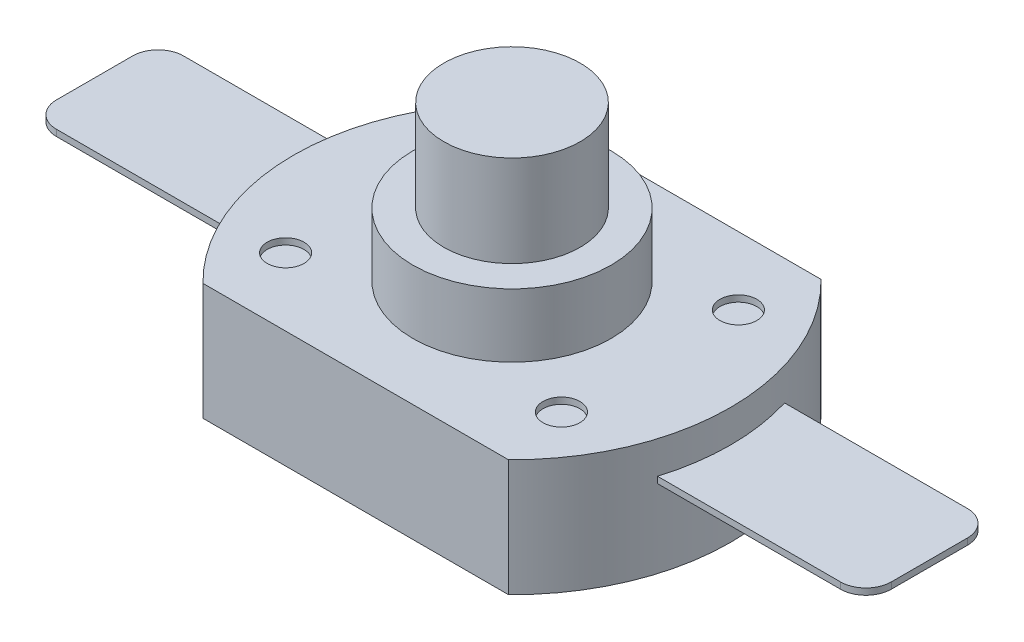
ISO-10303-21;
HEADER;
FILE_DESCRIPTION(('STEP AP214'),'2;1');
FILE_NAME('part.step','',(''),(''),'','','');
FILE_SCHEMA(('AUTOMOTIVE_DESIGN { 1 0 10303 214 1 1 1 1 }'));
ENDSEC;
DATA;
#1=APPLICATION_CONTEXT('core data for automotive mechanical design processes');
#2=APPLICATION_PROTOCOL_DEFINITION('international standard','automotive_design',2000,#1);
#3=PRODUCT_CONTEXT('',#1,'mechanical');
#4=PRODUCT('Part','Part','',(#3));
#5=PRODUCT_RELATED_PRODUCT_CATEGORY('part','',(#4));
#6=PRODUCT_DEFINITION_FORMATION('','',#4);
#7=PRODUCT_DEFINITION_CONTEXT('part definition',#1,'design');
#8=PRODUCT_DEFINITION('design','',#6,#7);
#9=PRODUCT_DEFINITION_SHAPE('','',#8);
#10=(LENGTH_UNIT() NAMED_UNIT(*) SI_UNIT(.MILLI.,.METRE.));
#11=(NAMED_UNIT(*) PLANE_ANGLE_UNIT() SI_UNIT($,.RADIAN.));
#12=(NAMED_UNIT(*) SI_UNIT($,.STERADIAN.) SOLID_ANGLE_UNIT());
#13=UNCERTAINTY_MEASURE_WITH_UNIT(LENGTH_MEASURE(1.E-05),#10,'distance_accuracy_value','');
#14=(GEOMETRIC_REPRESENTATION_CONTEXT(3) GLOBAL_UNCERTAINTY_ASSIGNED_CONTEXT((#13)) GLOBAL_UNIT_ASSIGNED_CONTEXT((#10,
#11,#12)) REPRESENTATION_CONTEXT('',''));
#15=CARTESIAN_POINT('',(0.,0.,0.));
#16=DIRECTION('',(0.,0.,1.));
#17=DIRECTION('',(1.,0.,0.));
#18=AXIS2_PLACEMENT_3D('',#15,#16,#17);
#19=CARTESIAN_POINT('',(0.,4.6,0.));
#20=DIRECTION('',(0.,-1.,0.));
#21=DIRECTION('',(0.,0.,-1.));
#22=AXIS2_PLACEMENT_3D('',#19,#20,#21);
#23=CYLINDRICAL_SURFACE('',#22,8.6);
#24=CARTESIAN_POINT('',(0.,0.,0.));
#25=DIRECTION('',(0.,1.,0.));
#26=DIRECTION('',(0.,0.,1.));
#27=AXIS2_PLACEMENT_3D('',#24,#25,#26);
#28=CIRCLE('',#27,8.6);
#29=CARTESIAN_POINT('',(6.01144741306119,0.,6.15));
#30=VERTEX_POINT('',#29);
#31=CARTESIAN_POINT('',(6.01144741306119,0.,-6.15));
#32=VERTEX_POINT('',#31);
#33=EDGE_CURVE('E243',#30,#32,#28,.T.);
#34=ORIENTED_EDGE('',*,*,#33,.T.);
#35=DIRECTION('',(0.,-1.,0.));
#36=VECTOR('',#35,1.);
#37=CARTESIAN_POINT('',(6.01144741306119,4.6,-6.15));
#38=LINE('',#37,#36);
#39=CARTESIAN_POINT('',(6.01144741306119,4.6,-6.15));
#40=VERTEX_POINT('',#39);
#41=EDGE_CURVE('E259',#40,#32,#38,.T.);
#42=ORIENTED_EDGE('',*,*,#41,.F.);
#43=CARTESIAN_POINT('',(0.,4.6,0.));
#44=DIRECTION('',(0.,1.,0.));
#45=DIRECTION('',(0.,0.,1.));
#46=AXIS2_PLACEMENT_3D('',#43,#44,#45);
#47=CIRCLE('',#46,8.6);
#48=CARTESIAN_POINT('',(6.01144741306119,4.6,6.15));
#49=VERTEX_POINT('',#48);
#50=EDGE_CURVE('E252',#49,#40,#47,.T.);
#51=ORIENTED_EDGE('',*,*,#50,.F.);
#52=DIRECTION('',(0.,-1.,0.));
#53=VECTOR('',#52,1.);
#54=CARTESIAN_POINT('',(6.01144741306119,4.6,6.15));
#55=LINE('',#54,#53);
#56=EDGE_CURVE('E262',#49,#30,#55,.T.);
#57=ORIENTED_EDGE('',*,*,#56,.T.);
#58=EDGE_LOOP('',(#34,#42,#51,#57));
#59=FACE_BOUND('',#58,.T.);
#60=CARTESIAN_POINT('',(0.,3.32,0.));
#61=DIRECTION('',(0.,-1.,0.));
#62=DIRECTION('',(0.,0.,-1.));
#63=AXIS2_PLACEMENT_3D('',#60,#61,#62);
#64=CIRCLE('',#63,8.6);
#65=CARTESIAN_POINT('',(8.22860863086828,3.32,-2.5));
#66=VERTEX_POINT('',#65);
#67=CARTESIAN_POINT('',(8.22860863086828,3.32,2.5));
#68=VERTEX_POINT('',#67);
#69=EDGE_CURVE('E11',#66,#68,#64,.T.);
#70=ORIENTED_EDGE('',*,*,#69,.F.);
#71=DIRECTION('',(0.,-1.,0.));
#72=VECTOR('',#71,1.);
#73=CARTESIAN_POINT('',(8.22860863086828,3.32,-2.5));
#74=LINE('',#73,#72);
#75=CARTESIAN_POINT('',(8.22860863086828,3.07,-2.5));
#76=VERTEX_POINT('',#75);
#77=EDGE_CURVE('E156',#66,#76,#74,.T.);
#78=ORIENTED_EDGE('',*,*,#77,.T.);
#79=CARTESIAN_POINT('',(0.,3.07,0.));
#80=DIRECTION('',(0.,-1.,0.));
#81=DIRECTION('',(0.,0.,-1.));
#82=AXIS2_PLACEMENT_3D('',#79,#80,#81);
#83=CIRCLE('',#82,8.6);
#84=CARTESIAN_POINT('',(8.22860863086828,3.07,2.5));
#85=VERTEX_POINT('',#84);
#86=EDGE_CURVE('E34',#76,#85,#83,.T.);
#87=ORIENTED_EDGE('',*,*,#86,.T.);
#88=DIRECTION('',(0.,-1.,0.));
#89=VECTOR('',#88,1.);
#90=CARTESIAN_POINT('',(8.22860863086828,3.32,2.5));
#91=LINE('',#90,#89);
#92=EDGE_CURVE('E190',#68,#85,#91,.T.);
#93=ORIENTED_EDGE('',*,*,#92,.F.);
#94=EDGE_LOOP('',(#70,#78,#87,#93));
#95=FACE_BOUND('',#94,.T.);
#96=ADVANCED_FACE('F26',(#59,#95),#23,.T.);
#97=CARTESIAN_POINT('',(0.,7.1,0.));
#98=DIRECTION('',(0.,1.,0.));
#99=DIRECTION('',(0.,0.,1.));
#100=AXIS2_PLACEMENT_3D('',#97,#98,#99);
#101=PLANE('',#100);
#102=CARTESIAN_POINT('',(0.,7.1,0.));
#103=DIRECTION('',(0.,1.,0.));
#104=DIRECTION('',(0.,0.,1.));
#105=AXIS2_PLACEMENT_3D('',#102,#103,#104);
#106=CIRCLE('',#105,3.9);
#107=CARTESIAN_POINT('',(0.,7.1,3.9));
#108=VERTEX_POINT('',#107);
#109=EDGE_CURVE('E235',#108,#108,#106,.T.);
#110=ORIENTED_EDGE('',*,*,#109,.T.);
#111=EDGE_LOOP('',(#110));
#112=FACE_BOUND('',#111,.T.);
#113=CARTESIAN_POINT('',(0.,7.1,0.));
#114=DIRECTION('',(0.,1.,0.));
#115=DIRECTION('',(0.,0.,1.));
#116=AXIS2_PLACEMENT_3D('',#113,#114,#115);
#117=CIRCLE('',#116,2.683);
#118=CARTESIAN_POINT('',(0.,7.1,2.683));
#119=VERTEX_POINT('',#118);
#120=EDGE_CURVE('E229',#119,#119,#117,.T.);
#121=ORIENTED_EDGE('',*,*,#120,.F.);
#122=EDGE_LOOP('',(#121));
#123=FACE_BOUND('',#122,.T.);
#124=ADVANCED_FACE('F305',(#112,#123),#101,.T.);
#125=CARTESIAN_POINT('',(0.,4.6,0.));
#126=DIRECTION('',(0.,-1.,0.));
#127=DIRECTION('',(0.,0.,-1.));
#128=AXIS2_PLACEMENT_3D('',#125,#126,#127);
#129=PLANE('',#128);
#130=CARTESIAN_POINT('',(-5.42779033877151,4.6,3.48197870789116));
#131=DIRECTION('',(0.,1.,0.));
#132=DIRECTION('',(0.,0.,-1.));
#133=AXIS2_PLACEMENT_3D('',#130,#131,#132);
#134=CIRCLE('',#133,0.725763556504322);
#135=CARTESIAN_POINT('',(-5.42779033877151,4.6,2.75621515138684));
#136=VERTEX_POINT('',#135);
#137=EDGE_CURVE('E548',#136,#136,#134,.T.);
#138=ORIENTED_EDGE('',*,*,#137,.F.);
#139=EDGE_LOOP('',(#138));
#140=FACE_BOUND('',#139,.T.);
#141=CARTESIAN_POINT('',(-5.42779033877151,4.6,-3.48197870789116));
#142=DIRECTION('',(0.,1.,0.));
#143=DIRECTION('',(0.,0.,1.));
#144=AXIS2_PLACEMENT_3D('',#141,#142,#143);
#145=CIRCLE('',#144,0.725763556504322);
#146=CARTESIAN_POINT('',(-5.42779033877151,4.6,-2.75621515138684));
#147=VERTEX_POINT('',#146);
#148=EDGE_CURVE('E547',#147,#147,#145,.T.);
#149=ORIENTED_EDGE('',*,*,#148,.F.);
#150=EDGE_LOOP('',(#149));
#151=FACE_BOUND('',#150,.T.);
#152=CARTESIAN_POINT('',(5.42779033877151,4.6,-3.48197870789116));
#153=DIRECTION('',(0.,1.,0.));
#154=DIRECTION('',(0.,0.,-1.));
#155=AXIS2_PLACEMENT_3D('',#152,#153,#154);
#156=CIRCLE('',#155,0.725763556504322);
#157=CARTESIAN_POINT('',(5.42779033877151,4.6,-4.20774226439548));
#158=VERTEX_POINT('',#157);
#159=EDGE_CURVE('E558',#158,#158,#156,.T.);
#160=ORIENTED_EDGE('',*,*,#159,.F.);
#161=EDGE_LOOP('',(#160));
#162=FACE_BOUND('',#161,.T.);
#163=CARTESIAN_POINT('',(5.42779033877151,4.6,3.48197870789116));
#164=DIRECTION('',(0.,1.,0.));
#165=DIRECTION('',(0.,0.,1.));
#166=AXIS2_PLACEMENT_3D('',#163,#164,#165);
#167=CIRCLE('',#166,0.725763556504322);
#168=CARTESIAN_POINT('',(5.42779033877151,4.6,4.20774226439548));
#169=VERTEX_POINT('',#168);
#170=EDGE_CURVE('E165',#169,#169,#167,.T.);
#171=ORIENTED_EDGE('',*,*,#170,.F.);
#172=EDGE_LOOP('',(#171));
#173=FACE_BOUND('',#172,.T.);
#174=CARTESIAN_POINT('',(0.,4.6,0.));
#175=DIRECTION('',(0.,1.,0.));
#176=DIRECTION('',(0.,0.,-1.));
#177=AXIS2_PLACEMENT_3D('',#174,#175,#176);
#178=CIRCLE('',#177,8.6);
#179=CARTESIAN_POINT('',(-6.01144741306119,4.6,-6.15));
#180=VERTEX_POINT('',#179);
#181=CARTESIAN_POINT('',(-6.01144741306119,4.6,6.15));
#182=VERTEX_POINT('',#181);
#183=EDGE_CURVE('E247',#180,#182,#178,.T.);
#184=ORIENTED_EDGE('',*,*,#183,.T.);
#185=DIRECTION('',(1.,0.,0.));
#186=VECTOR('',#185,1.);
#187=CARTESIAN_POINT('',(-6.01144741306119,4.6,6.15));
#188=LINE('',#187,#186);
#189=EDGE_CURVE('E250',#182,#49,#188,.T.);
#190=ORIENTED_EDGE('',*,*,#189,.T.);
#191=ORIENTED_EDGE('',*,*,#50,.T.);
#192=DIRECTION('',(-1.,0.,0.));
#193=VECTOR('',#192,1.);
#194=CARTESIAN_POINT('',(6.01144741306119,4.6,-6.15));
#195=LINE('',#194,#193);
#196=EDGE_CURVE('E254',#40,#180,#195,.T.);
#197=ORIENTED_EDGE('',*,*,#196,.T.);
#198=EDGE_LOOP('',(#184,#190,#191,#197));
#199=FACE_BOUND('',#198,.T.);
#200=CARTESIAN_POINT('',(0.,4.6,0.));
#201=DIRECTION('',(0.,-1.,0.));
#202=DIRECTION('',(0.,0.,-1.));
#203=AXIS2_PLACEMENT_3D('',#200,#201,#202);
#204=CIRCLE('',#203,3.9);
#205=CARTESIAN_POINT('',(0.,4.6,-3.9));
#206=VERTEX_POINT('',#205);
#207=EDGE_CURVE('E268',#206,#206,#204,.F.);
#208=ORIENTED_EDGE('',*,*,#207,.F.);
#209=EDGE_LOOP('',(#208));
#210=FACE_BOUND('',#209,.T.);
#211=ADVANCED_FACE('F313',(#140,#151,#162,#173,#199,#210),#129,.F.);
#212=CARTESIAN_POINT('',(0.,4.6,0.));
#213=DIRECTION('',(0.,-1.,0.));
#214=DIRECTION('',(0.,0.,-1.));
#215=AXIS2_PLACEMENT_3D('',#212,#213,#214);
#216=CYLINDRICAL_SURFACE('',#215,8.6);
#217=DIRECTION('',(0.,-1.,0.));
#218=VECTOR('',#217,1.);
#219=CARTESIAN_POINT('',(-8.22860863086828,3.32,-2.5));
#220=LINE('',#219,#218);
#221=CARTESIAN_POINT('',(-8.22860863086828,3.32,-2.5));
#222=VERTEX_POINT('',#221);
#223=CARTESIAN_POINT('',(-8.22860863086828,3.07,-2.5));
#224=VERTEX_POINT('',#223);
#225=EDGE_CURVE('E49',#222,#224,#220,.T.);
#226=ORIENTED_EDGE('',*,*,#225,.F.);
#227=CARTESIAN_POINT('',(0.,3.32,0.));
#228=DIRECTION('',(0.,1.,0.));
#229=DIRECTION('',(0.,0.,1.));
#230=AXIS2_PLACEMENT_3D('',#227,#228,#229);
#231=CIRCLE('',#230,8.6);
#232=CARTESIAN_POINT('',(-8.22860863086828,3.32,2.5));
#233=VERTEX_POINT('',#232);
#234=EDGE_CURVE('E274',#222,#233,#231,.T.);
#235=ORIENTED_EDGE('',*,*,#234,.T.);
#236=DIRECTION('',(0.,-1.,0.));
#237=VECTOR('',#236,1.);
#238=CARTESIAN_POINT('',(-8.22860863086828,3.32,2.5));
#239=LINE('',#238,#237);
#240=CARTESIAN_POINT('',(-8.22860863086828,3.07,2.5));
#241=VERTEX_POINT('',#240);
#242=EDGE_CURVE('E214',#233,#241,#239,.T.);
#243=ORIENTED_EDGE('',*,*,#242,.T.);
#244=CARTESIAN_POINT('',(0.,3.07,0.));
#245=DIRECTION('',(0.,1.,0.));
#246=DIRECTION('',(0.,0.,1.));
#247=AXIS2_PLACEMENT_3D('',#244,#245,#246);
#248=CIRCLE('',#247,8.6);
#249=EDGE_CURVE('E271',#224,#241,#248,.T.);
#250=ORIENTED_EDGE('',*,*,#249,.F.);
#251=EDGE_LOOP('',(#226,#235,#243,#250));
#252=FACE_BOUND('',#251,.T.);
#253=CARTESIAN_POINT('',(0.,0.,0.));
#254=DIRECTION('',(0.,1.,0.));
#255=DIRECTION('',(0.,0.,-1.));
#256=AXIS2_PLACEMENT_3D('',#253,#254,#255);
#257=CIRCLE('',#256,8.6);
#258=CARTESIAN_POINT('',(-6.01144741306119,0.,-6.15));
#259=VERTEX_POINT('',#258);
#260=CARTESIAN_POINT('',(-6.01144741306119,0.,6.15));
#261=VERTEX_POINT('',#260);
#262=EDGE_CURVE('E238',#259,#261,#257,.T.);
#263=ORIENTED_EDGE('',*,*,#262,.T.);
#264=DIRECTION('',(0.,-1.,0.));
#265=VECTOR('',#264,1.);
#266=CARTESIAN_POINT('',(-6.01144741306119,4.6,6.15));
#267=LINE('',#266,#265);
#268=EDGE_CURVE('E265',#182,#261,#267,.T.);
#269=ORIENTED_EDGE('',*,*,#268,.F.);
#270=ORIENTED_EDGE('',*,*,#183,.F.);
#271=DIRECTION('',(0.,-1.,0.));
#272=VECTOR('',#271,1.);
#273=CARTESIAN_POINT('',(-6.01144741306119,4.6,-6.15));
#274=LINE('',#273,#272);
#275=EDGE_CURVE('E256',#180,#259,#274,.T.);
#276=ORIENTED_EDGE('',*,*,#275,.T.);
#277=EDGE_LOOP('',(#263,#269,#270,#276));
#278=FACE_BOUND('',#277,.T.);
#279=ADVANCED_FACE('F28',(#252,#278),#216,.T.);
#280=CARTESIAN_POINT('',(-6.01144741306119,4.6,6.15));
#281=DIRECTION('',(0.,0.,-1.));
#282=DIRECTION('',(-1.,0.,0.));
#283=AXIS2_PLACEMENT_3D('',#280,#281,#282);
#284=PLANE('',#283);
#285=DIRECTION('',(1.,0.,0.));
#286=VECTOR('',#285,1.);
#287=CARTESIAN_POINT('',(-6.01144741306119,0.,6.15));
#288=LINE('',#287,#286);
#289=EDGE_CURVE('E241',#261,#30,#288,.T.);
#290=ORIENTED_EDGE('',*,*,#289,.T.);
#291=ORIENTED_EDGE('',*,*,#56,.F.);
#292=ORIENTED_EDGE('',*,*,#189,.F.);
#293=ORIENTED_EDGE('',*,*,#268,.T.);
#294=EDGE_LOOP('',(#290,#291,#292,#293));
#295=FACE_BOUND('',#294,.T.);
#296=ADVANCED_FACE('F319',(#295),#284,.F.);
#297=CARTESIAN_POINT('',(6.01144741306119,4.6,-6.15));
#298=DIRECTION('',(0.,0.,1.));
#299=DIRECTION('',(1.,0.,0.));
#300=AXIS2_PLACEMENT_3D('',#297,#298,#299);
#301=PLANE('',#300);
#302=DIRECTION('',(-1.,0.,0.));
#303=VECTOR('',#302,1.);
#304=CARTESIAN_POINT('',(6.01144741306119,0.,-6.15));
#305=LINE('',#304,#303);
#306=EDGE_CURVE('E245',#32,#259,#305,.T.);
#307=ORIENTED_EDGE('',*,*,#306,.T.);
#308=ORIENTED_EDGE('',*,*,#275,.F.);
#309=ORIENTED_EDGE('',*,*,#196,.F.);
#310=ORIENTED_EDGE('',*,*,#41,.T.);
#311=EDGE_LOOP('',(#307,#308,#309,#310));
#312=FACE_BOUND('',#311,.T.);
#313=ADVANCED_FACE('F317',(#312),#301,.F.);
#314=CARTESIAN_POINT('',(0.,0.,0.));
#315=DIRECTION('',(0.,-1.,0.));
#316=DIRECTION('',(0.,0.,-1.));
#317=AXIS2_PLACEMENT_3D('',#314,#315,#316);
#318=PLANE('',#317);
#319=ORIENTED_EDGE('',*,*,#262,.F.);
#320=ORIENTED_EDGE('',*,*,#306,.F.);
#321=ORIENTED_EDGE('',*,*,#33,.F.);
#322=ORIENTED_EDGE('',*,*,#289,.F.);
#323=EDGE_LOOP('',(#319,#320,#321,#322));
#324=FACE_BOUND('',#323,.T.);
#325=ADVANCED_FACE('F325',(#324),#318,.T.);
#326=CARTESIAN_POINT('',(0.,7.1,0.));
#327=DIRECTION('',(0.,-1.,0.));
#328=DIRECTION('',(0.,0.,-1.));
#329=AXIS2_PLACEMENT_3D('',#326,#327,#328);
#330=CYLINDRICAL_SURFACE('',#329,3.9);
#331=ORIENTED_EDGE('',*,*,#109,.F.);
#332=EDGE_LOOP('',(#331));
#333=FACE_BOUND('',#332,.T.);
#334=ORIENTED_EDGE('',*,*,#207,.T.);
#335=EDGE_LOOP('',(#334));
#336=FACE_BOUND('',#335,.T.);
#337=ADVANCED_FACE('F344',(#333,#336),#330,.T.);
#338=CARTESIAN_POINT('',(0.,10.7,0.));
#339=DIRECTION('',(0.,-1.,0.));
#340=DIRECTION('',(0.,0.,-1.));
#341=AXIS2_PLACEMENT_3D('',#338,#339,#340);
#342=CYLINDRICAL_SURFACE('',#341,2.683);
#343=CARTESIAN_POINT('',(0.,10.7,0.));
#344=DIRECTION('',(0.,1.,0.));
#345=DIRECTION('',(0.,0.,1.));
#346=AXIS2_PLACEMENT_3D('',#343,#344,#345);
#347=CIRCLE('',#346,2.683);
#348=CARTESIAN_POINT('',(0.,10.7,2.683));
#349=VERTEX_POINT('',#348);
#350=EDGE_CURVE('E232',#349,#349,#347,.T.);
#351=ORIENTED_EDGE('',*,*,#350,.F.);
#352=EDGE_LOOP('',(#351));
#353=FACE_BOUND('',#352,.T.);
#354=ORIENTED_EDGE('',*,*,#120,.T.);
#355=EDGE_LOOP('',(#354));
#356=FACE_BOUND('',#355,.T.);
#357=ADVANCED_FACE('F346',(#353,#356),#342,.T.);
#358=CARTESIAN_POINT('',(0.,10.7,0.));
#359=DIRECTION('',(0.,1.,0.));
#360=DIRECTION('',(0.,0.,1.));
#361=AXIS2_PLACEMENT_3D('',#358,#359,#360);
#362=PLANE('',#361);
#363=ORIENTED_EDGE('',*,*,#350,.T.);
#364=EDGE_LOOP('',(#363));
#365=FACE_BOUND('',#364,.T.);
#366=ADVANCED_FACE('F353',(#365),#362,.T.);
#367=CARTESIAN_POINT('',(-15.4286086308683,3.32,-1.5));
#368=DIRECTION('',(0.,1.,0.));
#369=DIRECTION('',(0.,0.,1.));
#370=AXIS2_PLACEMENT_3D('',#367,#368,#369);
#371=PLANE('',#370);
#372=ORIENTED_EDGE('',*,*,#234,.F.);
#373=DIRECTION('',(-1.,0.,0.));
#374=VECTOR('',#373,1.);
#375=CARTESIAN_POINT('',(-8.22860863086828,3.32,-2.5));
#376=LINE('',#375,#374);
#377=CARTESIAN_POINT('',(-15.4286086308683,3.32,-2.5));
#378=VERTEX_POINT('',#377);
#379=EDGE_CURVE('E203',#222,#378,#376,.T.);
#380=ORIENTED_EDGE('',*,*,#379,.T.);
#381=CARTESIAN_POINT('',(-15.4286086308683,3.32,-1.5));
#382=DIRECTION('',(0.,1.,0.));
#383=DIRECTION('',(0.,0.,1.));
#384=AXIS2_PLACEMENT_3D('',#381,#382,#383);
#385=CIRCLE('',#384,1.);
#386=CARTESIAN_POINT('',(-16.4286086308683,3.32,-1.5));
#387=VERTEX_POINT('',#386);
#388=EDGE_CURVE('E205',#378,#387,#385,.T.);
#389=ORIENTED_EDGE('',*,*,#388,.T.);
#390=DIRECTION('',(0.,0.,1.));
#391=VECTOR('',#390,1.);
#392=CARTESIAN_POINT('',(-16.4286086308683,3.32,1.5));
#393=LINE('',#392,#391);
#394=CARTESIAN_POINT('',(-16.4286086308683,3.32,1.5));
#395=VERTEX_POINT('',#394);
#396=EDGE_CURVE('E207',#387,#395,#393,.T.);
#397=ORIENTED_EDGE('',*,*,#396,.T.);
#398=CARTESIAN_POINT('',(-15.4286086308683,3.32,1.5));
#399=DIRECTION('',(0.,1.,0.));
#400=DIRECTION('',(0.,0.,-1.));
#401=AXIS2_PLACEMENT_3D('',#398,#399,#400);
#402=CIRCLE('',#401,1.);
#403=CARTESIAN_POINT('',(-15.4286086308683,3.32,2.5));
#404=VERTEX_POINT('',#403);
#405=EDGE_CURVE('E209',#395,#404,#402,.T.);
#406=ORIENTED_EDGE('',*,*,#405,.T.);
#407=DIRECTION('',(1.,0.,0.));
#408=VECTOR('',#407,1.);
#409=CARTESIAN_POINT('',(-8.22860863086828,3.32,2.5));
#410=LINE('',#409,#408);
#411=EDGE_CURVE('E211',#404,#233,#410,.T.);
#412=ORIENTED_EDGE('',*,*,#411,.T.);
#413=EDGE_LOOP('',(#372,#380,#389,#397,#406,#412));
#414=FACE_BOUND('',#413,.T.);
#415=ADVANCED_FACE('F360',(#414),#371,.T.);
#416=CARTESIAN_POINT('',(-15.4286086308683,3.07,-1.5));
#417=DIRECTION('',(0.,1.,0.));
#418=DIRECTION('',(0.,0.,1.));
#419=AXIS2_PLACEMENT_3D('',#416,#417,#418);
#420=PLANE('',#419);
#421=DIRECTION('',(-1.,0.,0.));
#422=VECTOR('',#421,1.);
#423=CARTESIAN_POINT('',(-8.22860863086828,3.07,-2.5));
#424=LINE('',#423,#422);
#425=CARTESIAN_POINT('',(-15.4286086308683,3.07,-2.5));
#426=VERTEX_POINT('',#425);
#427=EDGE_CURVE('E155',#224,#426,#424,.T.);
#428=ORIENTED_EDGE('',*,*,#427,.F.);
#429=ORIENTED_EDGE('',*,*,#249,.T.);
#430=DIRECTION('',(1.,0.,0.));
#431=VECTOR('',#430,1.);
#432=CARTESIAN_POINT('',(-8.22860863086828,3.07,2.5));
#433=LINE('',#432,#431);
#434=CARTESIAN_POINT('',(-15.4286086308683,3.07,2.5));
#435=VERTEX_POINT('',#434);
#436=EDGE_CURVE('E200',#435,#241,#433,.T.);
#437=ORIENTED_EDGE('',*,*,#436,.F.);
#438=CARTESIAN_POINT('',(-15.4286086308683,3.07,1.5));
#439=DIRECTION('',(0.,1.,0.));
#440=DIRECTION('',(0.,0.,-1.));
#441=AXIS2_PLACEMENT_3D('',#438,#439,#440);
#442=CIRCLE('',#441,1.);
#443=CARTESIAN_POINT('',(-16.4286086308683,3.07,1.5));
#444=VERTEX_POINT('',#443);
#445=EDGE_CURVE('E198',#444,#435,#442,.T.);
#446=ORIENTED_EDGE('',*,*,#445,.F.);
#447=DIRECTION('',(0.,0.,1.));
#448=VECTOR('',#447,1.);
#449=CARTESIAN_POINT('',(-16.4286086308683,3.07,1.5));
#450=LINE('',#449,#448);
#451=CARTESIAN_POINT('',(-16.4286086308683,3.07,-1.5));
#452=VERTEX_POINT('',#451);
#453=EDGE_CURVE('E196',#452,#444,#450,.T.);
#454=ORIENTED_EDGE('',*,*,#453,.F.);
#455=CARTESIAN_POINT('',(-15.4286086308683,3.07,-1.5));
#456=DIRECTION('',(0.,1.,0.));
#457=DIRECTION('',(0.,0.,1.));
#458=AXIS2_PLACEMENT_3D('',#455,#456,#457);
#459=CIRCLE('',#458,1.);
#460=EDGE_CURVE('E194',#426,#452,#459,.T.);
#461=ORIENTED_EDGE('',*,*,#460,.F.);
#462=EDGE_LOOP('',(#428,#429,#437,#446,#454,#461));
#463=FACE_BOUND('',#462,.T.);
#464=ADVANCED_FACE('F366',(#463),#420,.F.);
#465=CARTESIAN_POINT('',(-8.22860863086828,3.32,-2.5));
#466=DIRECTION('',(0.,0.,1.));
#467=DIRECTION('',(1.,0.,0.));
#468=AXIS2_PLACEMENT_3D('',#465,#466,#467);
#469=PLANE('',#468);
#470=ORIENTED_EDGE('',*,*,#427,.T.);
#471=DIRECTION('',(0.,-1.,0.));
#472=VECTOR('',#471,1.);
#473=CARTESIAN_POINT('',(-15.4286086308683,3.32,-2.5));
#474=LINE('',#473,#472);
#475=EDGE_CURVE('E225',#378,#426,#474,.T.);
#476=ORIENTED_EDGE('',*,*,#475,.F.);
#477=ORIENTED_EDGE('',*,*,#379,.F.);
#478=ORIENTED_EDGE('',*,*,#225,.T.);
#479=EDGE_LOOP('',(#470,#476,#477,#478));
#480=FACE_BOUND('',#479,.T.);
#481=ADVANCED_FACE('F362',(#480),#469,.F.);
#482=CARTESIAN_POINT('',(-15.4286086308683,3.32,-1.5));
#483=DIRECTION('',(0.,-1.,0.));
#484=DIRECTION('',(0.,0.,-1.));
#485=AXIS2_PLACEMENT_3D('',#482,#483,#484);
#486=CYLINDRICAL_SURFACE('',#485,1.);
#487=ORIENTED_EDGE('',*,*,#460,.T.);
#488=DIRECTION('',(0.,-1.,0.));
#489=VECTOR('',#488,1.);
#490=CARTESIAN_POINT('',(-16.4286086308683,3.32,-1.5));
#491=LINE('',#490,#489);
#492=EDGE_CURVE('E222',#387,#452,#491,.T.);
#493=ORIENTED_EDGE('',*,*,#492,.F.);
#494=ORIENTED_EDGE('',*,*,#388,.F.);
#495=ORIENTED_EDGE('',*,*,#475,.T.);
#496=EDGE_LOOP('',(#487,#493,#494,#495));
#497=FACE_BOUND('',#496,.T.);
#498=ADVANCED_FACE('F365',(#497),#486,.T.);
#499=CARTESIAN_POINT('',(-16.4286086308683,3.32,1.5));
#500=DIRECTION('',(1.,0.,0.));
#501=DIRECTION('',(0.,0.,-1.));
#502=AXIS2_PLACEMENT_3D('',#499,#500,#501);
#503=PLANE('',#502);
#504=ORIENTED_EDGE('',*,*,#453,.T.);
#505=DIRECTION('',(0.,-1.,0.));
#506=VECTOR('',#505,1.);
#507=CARTESIAN_POINT('',(-16.4286086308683,3.32,1.5));
#508=LINE('',#507,#506);
#509=EDGE_CURVE('E219',#395,#444,#508,.T.);
#510=ORIENTED_EDGE('',*,*,#509,.F.);
#511=ORIENTED_EDGE('',*,*,#396,.F.);
#512=ORIENTED_EDGE('',*,*,#492,.T.);
#513=EDGE_LOOP('',(#504,#510,#511,#512));
#514=FACE_BOUND('',#513,.T.);
#515=ADVANCED_FACE('F370',(#514),#503,.F.);
#516=CARTESIAN_POINT('',(-15.4286086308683,3.32,1.5));
#517=DIRECTION('',(0.,-1.,0.));
#518=DIRECTION('',(0.,0.,-1.));
#519=AXIS2_PLACEMENT_3D('',#516,#517,#518);
#520=CYLINDRICAL_SURFACE('',#519,1.);
#521=ORIENTED_EDGE('',*,*,#445,.T.);
#522=DIRECTION('',(0.,-1.,0.));
#523=VECTOR('',#522,1.);
#524=CARTESIAN_POINT('',(-15.4286086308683,3.32,2.5));
#525=LINE('',#524,#523);
#526=EDGE_CURVE('E216',#404,#435,#525,.T.);
#527=ORIENTED_EDGE('',*,*,#526,.F.);
#528=ORIENTED_EDGE('',*,*,#405,.F.);
#529=ORIENTED_EDGE('',*,*,#509,.T.);
#530=EDGE_LOOP('',(#521,#527,#528,#529));
#531=FACE_BOUND('',#530,.T.);
#532=ADVANCED_FACE('F374',(#531),#520,.T.);
#533=CARTESIAN_POINT('',(-8.22860863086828,3.32,2.5));
#534=DIRECTION('',(0.,0.,-1.));
#535=DIRECTION('',(-1.,0.,0.));
#536=AXIS2_PLACEMENT_3D('',#533,#534,#535);
#537=PLANE('',#536);
#538=ORIENTED_EDGE('',*,*,#436,.T.);
#539=ORIENTED_EDGE('',*,*,#242,.F.);
#540=ORIENTED_EDGE('',*,*,#411,.F.);
#541=ORIENTED_EDGE('',*,*,#526,.T.);
#542=EDGE_LOOP('',(#538,#539,#540,#541));
#543=FACE_BOUND('',#542,.T.);
#544=ADVANCED_FACE('F378',(#543),#537,.F.);
#545=CARTESIAN_POINT('',(15.4286086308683,3.32,-1.5));
#546=DIRECTION('',(0.,-1.,0.));
#547=DIRECTION('',(0.,0.,-1.));
#548=AXIS2_PLACEMENT_3D('',#545,#546,#547);
#549=PLANE('',#548);
#550=DIRECTION('',(-1.,0.,0.));
#551=VECTOR('',#550,1.);
#552=CARTESIAN_POINT('',(8.22860863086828,3.32,-2.5));
#553=LINE('',#552,#551);
#554=CARTESIAN_POINT('',(15.4286086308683,3.32,-2.5));
#555=VERTEX_POINT('',#554);
#556=EDGE_CURVE('E151',#555,#66,#553,.T.);
#557=ORIENTED_EDGE('',*,*,#556,.T.);
#558=ORIENTED_EDGE('',*,*,#69,.T.);
#559=DIRECTION('',(1.,0.,0.));
#560=VECTOR('',#559,1.);
#561=CARTESIAN_POINT('',(8.22860863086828,3.32,2.5));
#562=LINE('',#561,#560);
#563=CARTESIAN_POINT('',(15.4286086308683,3.32,2.5));
#564=VERTEX_POINT('',#563);
#565=EDGE_CURVE('E177',#68,#564,#562,.T.);
#566=ORIENTED_EDGE('',*,*,#565,.T.);
#567=CARTESIAN_POINT('',(15.4286086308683,3.32,1.5));
#568=DIRECTION('',(0.,1.,0.));
#569=DIRECTION('',(0.,0.,1.));
#570=AXIS2_PLACEMENT_3D('',#567,#568,#569);
#571=CIRCLE('',#570,1.);
#572=CARTESIAN_POINT('',(16.4286086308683,3.32,1.5));
#573=VERTEX_POINT('',#572);
#574=EDGE_CURVE('E179',#564,#573,#571,.T.);
#575=ORIENTED_EDGE('',*,*,#574,.T.);
#576=DIRECTION('',(0.,0.,-1.));
#577=VECTOR('',#576,1.);
#578=CARTESIAN_POINT('',(16.4286086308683,3.32,1.5));
#579=LINE('',#578,#577);
#580=CARTESIAN_POINT('',(16.4286086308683,3.32,-1.5));
#581=VERTEX_POINT('',#580);
#582=EDGE_CURVE('E181',#573,#581,#579,.T.);
#583=ORIENTED_EDGE('',*,*,#582,.T.);
#584=CARTESIAN_POINT('',(15.4286086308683,3.32,-1.5));
#585=DIRECTION('',(0.,1.,0.));
#586=DIRECTION('',(0.,0.,-1.));
#587=AXIS2_PLACEMENT_3D('',#584,#585,#586);
#588=CIRCLE('',#587,1.);
#589=EDGE_CURVE('E174',#581,#555,#588,.T.);
#590=ORIENTED_EDGE('',*,*,#589,.T.);
#591=EDGE_LOOP('',(#557,#558,#566,#575,#583,#590));
#592=FACE_BOUND('',#591,.T.);
#593=ADVANCED_FACE('F280',(#592),#549,.F.);
#594=CARTESIAN_POINT('',(15.4286086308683,3.07,-1.5));
#595=DIRECTION('',(0.,-1.,0.));
#596=DIRECTION('',(0.,0.,-1.));
#597=AXIS2_PLACEMENT_3D('',#594,#595,#596);
#598=PLANE('',#597);
#599=ORIENTED_EDGE('',*,*,#86,.F.);
#600=DIRECTION('',(-1.,0.,0.));
#601=VECTOR('',#600,1.);
#602=CARTESIAN_POINT('',(8.22860863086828,3.07,-2.5));
#603=LINE('',#602,#601);
#604=CARTESIAN_POINT('',(15.4286086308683,3.07,-2.5));
#605=VERTEX_POINT('',#604);
#606=EDGE_CURVE('E137',#605,#76,#603,.T.);
#607=ORIENTED_EDGE('',*,*,#606,.F.);
#608=CARTESIAN_POINT('',(15.4286086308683,3.07,-1.5));
#609=DIRECTION('',(0.,1.,0.));
#610=DIRECTION('',(0.,0.,-1.));
#611=AXIS2_PLACEMENT_3D('',#608,#609,#610);
#612=CIRCLE('',#611,1.);
#613=CARTESIAN_POINT('',(16.4286086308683,3.07,-1.5));
#614=VERTEX_POINT('',#613);
#615=EDGE_CURVE('E142',#614,#605,#612,.T.);
#616=ORIENTED_EDGE('',*,*,#615,.F.);
#617=DIRECTION('',(0.,0.,-1.));
#618=VECTOR('',#617,1.);
#619=CARTESIAN_POINT('',(16.4286086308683,3.07,1.5));
#620=LINE('',#619,#618);
#621=CARTESIAN_POINT('',(16.4286086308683,3.07,1.5));
#622=VERTEX_POINT('',#621);
#623=EDGE_CURVE('E172',#622,#614,#620,.T.);
#624=ORIENTED_EDGE('',*,*,#623,.F.);
#625=CARTESIAN_POINT('',(15.4286086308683,3.07,1.5));
#626=DIRECTION('',(0.,1.,0.));
#627=DIRECTION('',(0.,0.,1.));
#628=AXIS2_PLACEMENT_3D('',#625,#626,#627);
#629=CIRCLE('',#628,1.);
#630=CARTESIAN_POINT('',(15.4286086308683,3.07,2.5));
#631=VERTEX_POINT('',#630);
#632=EDGE_CURVE('E170',#631,#622,#629,.T.);
#633=ORIENTED_EDGE('',*,*,#632,.F.);
#634=DIRECTION('',(1.,0.,0.));
#635=VECTOR('',#634,1.);
#636=CARTESIAN_POINT('',(8.22860863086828,3.07,2.5));
#637=LINE('',#636,#635);
#638=EDGE_CURVE('E41',#85,#631,#637,.T.);
#639=ORIENTED_EDGE('',*,*,#638,.F.);
#640=EDGE_LOOP('',(#599,#607,#616,#624,#633,#639));
#641=FACE_BOUND('',#640,.T.);
#642=ADVANCED_FACE('F139',(#641),#598,.T.);
#643=CARTESIAN_POINT('',(15.4286086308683,3.32,-1.5));
#644=DIRECTION('',(0.,-1.,0.));
#645=DIRECTION('',(0.,0.,-1.));
#646=AXIS2_PLACEMENT_3D('',#643,#644,#645);
#647=CYLINDRICAL_SURFACE('',#646,1.);
#648=ORIENTED_EDGE('',*,*,#615,.T.);
#649=DIRECTION('',(0.,-1.,0.));
#650=VECTOR('',#649,1.);
#651=CARTESIAN_POINT('',(15.4286086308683,3.32,-2.5));
#652=LINE('',#651,#650);
#653=EDGE_CURVE('E149',#555,#605,#652,.T.);
#654=ORIENTED_EDGE('',*,*,#653,.F.);
#655=ORIENTED_EDGE('',*,*,#589,.F.);
#656=DIRECTION('',(0.,-1.,0.));
#657=VECTOR('',#656,1.);
#658=CARTESIAN_POINT('',(16.4286086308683,3.32,-1.5));
#659=LINE('',#658,#657);
#660=EDGE_CURVE('E161',#581,#614,#659,.T.);
#661=ORIENTED_EDGE('',*,*,#660,.T.);
#662=EDGE_LOOP('',(#648,#654,#655,#661));
#663=FACE_BOUND('',#662,.T.);
#664=ADVANCED_FACE('F159',(#663),#647,.T.);
#665=CARTESIAN_POINT('',(8.22860863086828,3.32,-2.5));
#666=DIRECTION('',(0.,0.,1.));
#667=DIRECTION('',(1.,0.,0.));
#668=AXIS2_PLACEMENT_3D('',#665,#666,#667);
#669=PLANE('',#668);
#670=ORIENTED_EDGE('',*,*,#606,.T.);
#671=ORIENTED_EDGE('',*,*,#77,.F.);
#672=ORIENTED_EDGE('',*,*,#556,.F.);
#673=ORIENTED_EDGE('',*,*,#653,.T.);
#674=EDGE_LOOP('',(#670,#671,#672,#673));
#675=FACE_BOUND('',#674,.T.);
#676=ADVANCED_FACE('F150',(#675),#669,.F.);
#677=CARTESIAN_POINT('',(8.22860863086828,3.32,2.5));
#678=DIRECTION('',(0.,0.,-1.));
#679=DIRECTION('',(-1.,0.,0.));
#680=AXIS2_PLACEMENT_3D('',#677,#678,#679);
#681=PLANE('',#680);
#682=ORIENTED_EDGE('',*,*,#638,.T.);
#683=DIRECTION('',(0.,-1.,0.));
#684=VECTOR('',#683,1.);
#685=CARTESIAN_POINT('',(15.4286086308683,3.32,2.5));
#686=LINE('',#685,#684);
#687=EDGE_CURVE('E187',#564,#631,#686,.T.);
#688=ORIENTED_EDGE('',*,*,#687,.F.);
#689=ORIENTED_EDGE('',*,*,#565,.F.);
#690=ORIENTED_EDGE('',*,*,#92,.T.);
#691=EDGE_LOOP('',(#682,#688,#689,#690));
#692=FACE_BOUND('',#691,.T.);
#693=ADVANCED_FACE('F283',(#692),#681,.F.);
#694=CARTESIAN_POINT('',(15.4286086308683,3.32,1.5));
#695=DIRECTION('',(0.,-1.,0.));
#696=DIRECTION('',(0.,0.,-1.));
#697=AXIS2_PLACEMENT_3D('',#694,#695,#696);
#698=CYLINDRICAL_SURFACE('',#697,1.);
#699=ORIENTED_EDGE('',*,*,#632,.T.);
#700=DIRECTION('',(0.,-1.,0.));
#701=VECTOR('',#700,1.);
#702=CARTESIAN_POINT('',(16.4286086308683,3.32,1.5));
#703=LINE('',#702,#701);
#704=EDGE_CURVE('E184',#573,#622,#703,.T.);
#705=ORIENTED_EDGE('',*,*,#704,.F.);
#706=ORIENTED_EDGE('',*,*,#574,.F.);
#707=ORIENTED_EDGE('',*,*,#687,.T.);
#708=EDGE_LOOP('',(#699,#705,#706,#707));
#709=FACE_BOUND('',#708,.T.);
#710=ADVANCED_FACE('F287',(#709),#698,.T.);
#711=CARTESIAN_POINT('',(16.4286086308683,3.32,1.5));
#712=DIRECTION('',(-1.,0.,0.));
#713=DIRECTION('',(0.,0.,1.));
#714=AXIS2_PLACEMENT_3D('',#711,#712,#713);
#715=PLANE('',#714);
#716=ORIENTED_EDGE('',*,*,#623,.T.);
#717=ORIENTED_EDGE('',*,*,#660,.F.);
#718=ORIENTED_EDGE('',*,*,#582,.F.);
#719=ORIENTED_EDGE('',*,*,#704,.T.);
#720=EDGE_LOOP('',(#716,#717,#718,#719));
#721=FACE_BOUND('',#720,.T.);
#722=ADVANCED_FACE('F290',(#721),#715,.F.);
#723=CARTESIAN_POINT('',(5.42779033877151,4.35,3.48197870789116));
#724=DIRECTION('',(0.,1.,0.));
#725=DIRECTION('',(0.,0.,1.));
#726=AXIS2_PLACEMENT_3D('',#723,#724,#725);
#727=CYLINDRICAL_SURFACE('',#726,0.725763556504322);
#728=CARTESIAN_POINT('',(5.42779033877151,4.35,3.48197870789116));
#729=DIRECTION('',(0.,1.,0.));
#730=DIRECTION('',(0.,0.,1.));
#731=AXIS2_PLACEMENT_3D('',#728,#729,#730);
#732=CIRCLE('',#731,0.725763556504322);
#733=CARTESIAN_POINT('',(5.42779033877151,4.35,4.20774226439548));
#734=VERTEX_POINT('',#733);
#735=EDGE_CURVE('E162',#734,#734,#732,.T.);
#736=ORIENTED_EDGE('',*,*,#735,.F.);
#737=EDGE_LOOP('',(#736));
#738=FACE_BOUND('',#737,.T.);
#739=ORIENTED_EDGE('',*,*,#170,.T.);
#740=EDGE_LOOP('',(#739));
#741=FACE_BOUND('',#740,.T.);
#742=ADVANCED_FACE('F292',(#738,#741),#727,.F.);
#743=CARTESIAN_POINT('',(5.42779033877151,4.35,3.48197870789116));
#744=DIRECTION('',(0.,1.,0.));
#745=DIRECTION('',(0.,0.,1.));
#746=AXIS2_PLACEMENT_3D('',#743,#744,#745);
#747=PLANE('',#746);
#748=ORIENTED_EDGE('',*,*,#735,.T.);
#749=EDGE_LOOP('',(#748));
#750=FACE_BOUND('',#749,.T.);
#751=ADVANCED_FACE('F299',(#750),#747,.T.);
#752=CARTESIAN_POINT('',(5.42779033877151,4.35,-3.48197870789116));
#753=DIRECTION('',(0.,1.,0.));
#754=DIRECTION('',(0.,0.,1.));
#755=AXIS2_PLACEMENT_3D('',#752,#753,#754);
#756=CYLINDRICAL_SURFACE('',#755,0.725763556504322);
#757=CARTESIAN_POINT('',(5.42779033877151,4.35,-3.48197870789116));
#758=DIRECTION('',(0.,1.,0.));
#759=DIRECTION('',(0.,0.,-1.));
#760=AXIS2_PLACEMENT_3D('',#757,#758,#759);
#761=CIRCLE('',#760,0.725763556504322);
#762=CARTESIAN_POINT('',(5.42779033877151,4.35,-4.20774226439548));
#763=VERTEX_POINT('',#762);
#764=EDGE_CURVE('E561',#763,#763,#761,.T.);
#765=ORIENTED_EDGE('',*,*,#764,.F.);
#766=EDGE_LOOP('',(#765));
#767=FACE_BOUND('',#766,.T.);
#768=ORIENTED_EDGE('',*,*,#159,.T.);
#769=EDGE_LOOP('',(#768));
#770=FACE_BOUND('',#769,.T.);
#771=ADVANCED_FACE('F415',(#767,#770),#756,.F.);
#772=CARTESIAN_POINT('',(5.42779033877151,4.35,-3.48197870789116));
#773=DIRECTION('',(0.,-1.,0.));
#774=DIRECTION('',(0.,0.,-1.));
#775=AXIS2_PLACEMENT_3D('',#772,#773,#774);
#776=PLANE('',#775);
#777=ORIENTED_EDGE('',*,*,#764,.T.);
#778=EDGE_LOOP('',(#777));
#779=FACE_BOUND('',#778,.T.);
#780=ADVANCED_FACE('F423',(#779),#776,.F.);
#781=CARTESIAN_POINT('',(-5.42779033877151,4.35,-3.48197870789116));
#782=DIRECTION('',(0.,1.,0.));
#783=DIRECTION('',(0.,0.,1.));
#784=AXIS2_PLACEMENT_3D('',#781,#782,#783);
#785=CYLINDRICAL_SURFACE('',#784,0.725763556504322);
#786=CARTESIAN_POINT('',(-5.42779033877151,4.35,-3.48197870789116));
#787=DIRECTION('',(0.,1.,0.));
#788=DIRECTION('',(0.,0.,1.));
#789=AXIS2_PLACEMENT_3D('',#786,#787,#788);
#790=CIRCLE('',#789,0.725763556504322);
#791=CARTESIAN_POINT('',(-5.42779033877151,4.35,-2.75621515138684));
#792=VERTEX_POINT('',#791);
#793=EDGE_CURVE('E551',#792,#792,#790,.T.);
#794=ORIENTED_EDGE('',*,*,#793,.F.);
#795=EDGE_LOOP('',(#794));
#796=FACE_BOUND('',#795,.T.);
#797=ORIENTED_EDGE('',*,*,#148,.T.);
#798=EDGE_LOOP('',(#797));
#799=FACE_BOUND('',#798,.T.);
#800=ADVANCED_FACE('F431',(#796,#799),#785,.F.);
#801=CARTESIAN_POINT('',(-5.42779033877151,4.35,-3.48197870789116));
#802=DIRECTION('',(0.,1.,0.));
#803=DIRECTION('',(0.,0.,1.));
#804=AXIS2_PLACEMENT_3D('',#801,#802,#803);
#805=PLANE('',#804);
#806=ORIENTED_EDGE('',*,*,#793,.T.);
#807=EDGE_LOOP('',(#806));
#808=FACE_BOUND('',#807,.T.);
#809=ADVANCED_FACE('F439',(#808),#805,.T.);
#810=CARTESIAN_POINT('',(-5.42779033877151,4.35,3.48197870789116));
#811=DIRECTION('',(0.,1.,0.));
#812=DIRECTION('',(0.,0.,1.));
#813=AXIS2_PLACEMENT_3D('',#810,#811,#812);
#814=CYLINDRICAL_SURFACE('',#813,0.725763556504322);
#815=CARTESIAN_POINT('',(-5.42779033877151,4.35,3.48197870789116));
#816=DIRECTION('',(0.,1.,0.));
#817=DIRECTION('',(0.,0.,-1.));
#818=AXIS2_PLACEMENT_3D('',#815,#816,#817);
#819=CIRCLE('',#818,0.725763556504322);
#820=CARTESIAN_POINT('',(-5.42779033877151,4.35,2.75621515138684));
#821=VERTEX_POINT('',#820);
#822=EDGE_CURVE('E546',#821,#821,#819,.T.);
#823=ORIENTED_EDGE('',*,*,#822,.F.);
#824=EDGE_LOOP('',(#823));
#825=FACE_BOUND('',#824,.T.);
#826=ORIENTED_EDGE('',*,*,#137,.T.);
#827=EDGE_LOOP('',(#826));
#828=FACE_BOUND('',#827,.T.);
#829=ADVANCED_FACE('F447',(#825,#828),#814,.F.);
#830=CARTESIAN_POINT('',(-5.42779033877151,4.35,3.48197870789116));
#831=DIRECTION('',(0.,-1.,0.));
#832=DIRECTION('',(0.,0.,-1.));
#833=AXIS2_PLACEMENT_3D('',#830,#831,#832);
#834=PLANE('',#833);
#835=ORIENTED_EDGE('',*,*,#822,.T.);
#836=EDGE_LOOP('',(#835));
#837=FACE_BOUND('',#836,.T.);
#838=ADVANCED_FACE('F455',(#837),#834,.F.);
#839=CLOSED_SHELL('',(#96,#124,#211,#279,#296,#313,#325,#337,#357,#366,#415,#464,#481,#498,#515,
#532,#544,#593,#642,#664,#676,#693,#710,#722,#742,#751,#771,#780,#800,#809,#829,#838));
#840=MANIFOLD_SOLID_BREP('B2',#839);
#841=ADVANCED_BREP_SHAPE_REPRESENTATION('',(#18,#840),#14);
#842=SHAPE_DEFINITION_REPRESENTATION(#9,#841);
ENDSEC;
END-ISO-10303-21;
